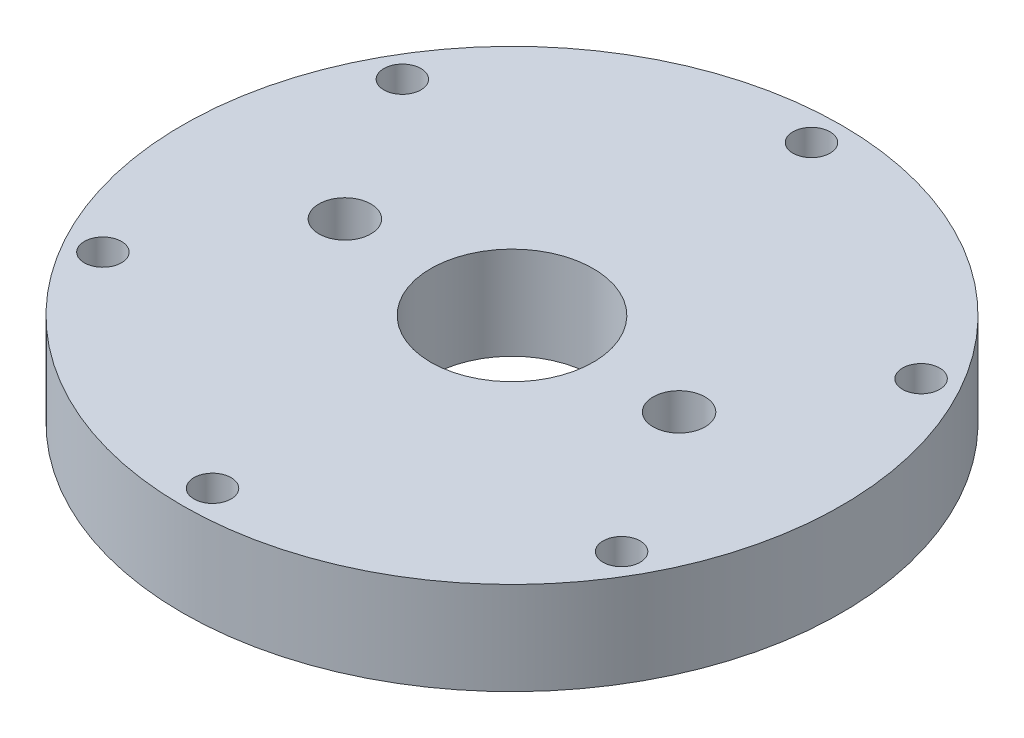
from build123d import *

# Parameters (mm, degrees)
SKETCH2_R           = 22.5425
SKETCH2_R_2         = 5.55625
SKETCH2_R_3         = 1.27
SKETCH2_R_4         = 1.778
BOSS_EXTRUDE1_DEPTH = 6.35


with BuildPart() as part:
    # Sketch2 → Boss-Extrude1 (new body)
    with BuildSketch(Plane(origin=(0, 0, 0), x_dir=(1, 0, 0), z_dir=(0, 1, 0))):
        with Locations(Location((0, 0, 0), (0, 0, 270))):
            Circle(SKETCH2_R)
        with Locations(Location((0, 0, 0), (0, 0, 270))):
            Circle(SKETCH2_R_2, mode=Mode.SUBTRACT)
        with Locations(Location((0, 20.4851, 0), (0, 0, 270))):
            Circle(SKETCH2_R_3, mode=Mode.SUBTRACT)
        with Locations(Location((17.740616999, 10.24255, 0), (0, 0, 270))):
            Circle(SKETCH2_R_3, mode=Mode.SUBTRACT)
        with Locations(Location((17.740616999, -10.24255, 0), (0, 0, 270))):
            Circle(SKETCH2_R_3, mode=Mode.SUBTRACT)
        with Locations(Location((0, -20.4851, 0), (0, 0, 270))):
            Circle(SKETCH2_R_3, mode=Mode.SUBTRACT)
        with Locations(Location((-17.740616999, -10.24255, 0), (0, 0, 270))):
            Circle(SKETCH2_R_3, mode=Mode.SUBTRACT)
        with Locations(Location((-17.740616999, 10.24255, 0), (0, 0, 270))):
            Circle(SKETCH2_R_3, mode=Mode.SUBTRACT)
        with Locations(Location((11.43, 0, 0), (0, 0, 270))):
            Circle(SKETCH2_R_4, mode=Mode.SUBTRACT)
        with Locations(Location((-11.43, 0, 0), (0, 0, 270))):
            Circle(SKETCH2_R_4, mode=Mode.SUBTRACT)
    extrude(amount=BOSS_EXTRUDE1_DEPTH)


solid = part.part
